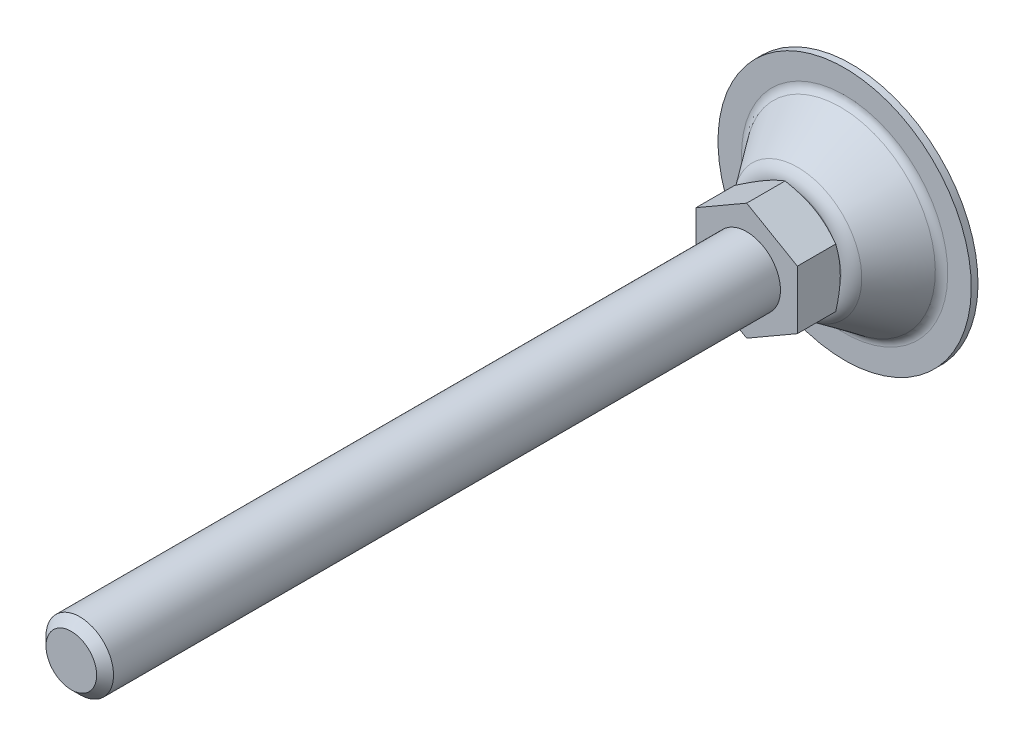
ISO-10303-21;
HEADER;
FILE_DESCRIPTION(('STEP AP214'),'2;1');
FILE_NAME('part.step','',(''),(''),'','','');
FILE_SCHEMA(('AUTOMOTIVE_DESIGN { 1 0 10303 214 1 1 1 1 }'));
ENDSEC;
DATA;
#1=APPLICATION_CONTEXT('core data for automotive mechanical design processes');
#2=APPLICATION_PROTOCOL_DEFINITION('international standard','automotive_design',2000,#1);
#3=PRODUCT_CONTEXT('',#1,'mechanical');
#4=PRODUCT('Part','Part','',(#3));
#5=PRODUCT_RELATED_PRODUCT_CATEGORY('part','',(#4));
#6=PRODUCT_DEFINITION_FORMATION('','',#4);
#7=PRODUCT_DEFINITION_CONTEXT('part definition',#1,'design');
#8=PRODUCT_DEFINITION('design','',#6,#7);
#9=PRODUCT_DEFINITION_SHAPE('','',#8);
#10=(LENGTH_UNIT() NAMED_UNIT(*) SI_UNIT(.MILLI.,.METRE.));
#11=(NAMED_UNIT(*) PLANE_ANGLE_UNIT() SI_UNIT($,.RADIAN.));
#12=(NAMED_UNIT(*) SI_UNIT($,.STERADIAN.) SOLID_ANGLE_UNIT());
#13=UNCERTAINTY_MEASURE_WITH_UNIT(LENGTH_MEASURE(1.E-05),#10,'distance_accuracy_value','');
#14=(GEOMETRIC_REPRESENTATION_CONTEXT(3) GLOBAL_UNCERTAINTY_ASSIGNED_CONTEXT((#13)) GLOBAL_UNIT_ASSIGNED_CONTEXT((#10,
#11,#12)) REPRESENTATION_CONTEXT('',''));
#15=CARTESIAN_POINT('',(0.,0.,0.));
#16=DIRECTION('',(0.,0.,1.));
#17=DIRECTION('',(1.,0.,0.));
#18=AXIS2_PLACEMENT_3D('',#15,#16,#17);
#19=CARTESIAN_POINT('',(0.,0.,31.));
#20=DIRECTION('',(0.,0.,1.));
#21=DIRECTION('',(0.5,-0.86602540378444,0.));
#22=AXIS2_PLACEMENT_3D('',#19,#20,#21);
#23=PLANE('',#22);
#24=DIRECTION('',(0.,1.,0.));
#25=VECTOR('',#24,1.);
#26=CARTESIAN_POINT('',(15.,-8.66025403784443,31.));
#27=LINE('',#26,#25);
#28=CARTESIAN_POINT('',(15.,-8.66025403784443,31.));
#29=VERTEX_POINT('',#28);
#30=CARTESIAN_POINT('',(15.,8.66025403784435,31.));
#31=VERTEX_POINT('',#30);
#32=EDGE_CURVE('E220',#29,#31,#27,.T.);
#33=ORIENTED_EDGE('',*,*,#32,.T.);
#34=DIRECTION('',(-0.866025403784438,0.5,0.));
#35=VECTOR('',#34,1.);
#36=CARTESIAN_POINT('',(15.,8.66025403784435,31.));
#37=LINE('',#36,#35);
#38=CARTESIAN_POINT('',(0.,17.3205080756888,31.));
#39=VERTEX_POINT('',#38);
#40=EDGE_CURVE('E266',#31,#39,#37,.T.);
#41=ORIENTED_EDGE('',*,*,#40,.T.);
#42=DIRECTION('',(-0.866025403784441,-0.5,0.));
#43=VECTOR('',#42,1.);
#44=CARTESIAN_POINT('',(0.,17.3205080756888,31.));
#45=LINE('',#44,#43);
#46=CARTESIAN_POINT('',(-15.,8.66025403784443,31.));
#47=VERTEX_POINT('',#46);
#48=EDGE_CURVE('E264',#39,#47,#45,.T.);
#49=ORIENTED_EDGE('',*,*,#48,.T.);
#50=DIRECTION('',(0.,-1.,0.));
#51=VECTOR('',#50,1.);
#52=CARTESIAN_POINT('',(-15.,8.66025403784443,31.));
#53=LINE('',#52,#51);
#54=CARTESIAN_POINT('',(-15.,-8.66025403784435,31.));
#55=VERTEX_POINT('',#54);
#56=EDGE_CURVE('E261',#47,#55,#53,.T.);
#57=ORIENTED_EDGE('',*,*,#56,.T.);
#58=DIRECTION('',(0.866025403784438,-0.5,0.));
#59=VECTOR('',#58,1.);
#60=CARTESIAN_POINT('',(-15.,-8.66025403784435,31.));
#61=LINE('',#60,#59);
#62=CARTESIAN_POINT('',(0.,-17.3205080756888,31.));
#63=VERTEX_POINT('',#62);
#64=EDGE_CURVE('E271',#55,#63,#61,.T.);
#65=ORIENTED_EDGE('',*,*,#64,.T.);
#66=DIRECTION('',(0.866025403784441,0.5,0.));
#67=VECTOR('',#66,1.);
#68=CARTESIAN_POINT('',(0.,-17.3205080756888,31.));
#69=LINE('',#68,#67);
#70=EDGE_CURVE('E37',#63,#29,#69,.T.);
#71=ORIENTED_EDGE('',*,*,#70,.T.);
#72=EDGE_LOOP('',(#33,#41,#49,#57,#65,#71));
#73=FACE_BOUND('',#72,.T.);
#74=CARTESIAN_POINT('',(0.,0.,31.));
#75=DIRECTION('',(0.,0.,1.));
#76=DIRECTION('',(0.5,-0.86602540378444,0.));
#77=AXIS2_PLACEMENT_3D('',#74,#75,#76);
#78=CIRCLE('',#77,10.);
#79=CARTESIAN_POINT('',(5.,-8.6602540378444,31.));
#80=VERTEX_POINT('',#79);
#81=EDGE_CURVE('E224',#80,#80,#78,.T.);
#82=ORIENTED_EDGE('',*,*,#81,.F.);
#83=EDGE_LOOP('',(#82));
#84=FACE_BOUND('',#83,.T.);
#85=ADVANCED_FACE('F14',(#73,#84),#23,.T.);
#86=CARTESIAN_POINT('',(-1.54390389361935E-13,2.67411998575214E-13,4.9999999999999));
#87=DIRECTION('',(0.,0.,1.));
#88=DIRECTION('',(0.5,-0.86602540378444,0.));
#89=AXIS2_PLACEMENT_3D('',#86,#87,#88);
#90=TOROIDAL_SURFACE('',#89,30.5382613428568,3.);
#91=CARTESIAN_POINT('',(-1.55741344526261E-13,2.69751921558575E-13,3.24909185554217));
#92=DIRECTION('',(0.,0.,1.));
#93=DIRECTION('',(0.5,-0.86602540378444,0.));
#94=AXIS2_PLACEMENT_3D('',#91,#92,#93);
#95=CIRCLE('',#94,28.1022152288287);
#96=CARTESIAN_POINT('',(14.0511076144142,-24.3372322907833,3.2490918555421));
#97=VERTEX_POINT('',#96);
#98=EDGE_CURVE('E73',#97,#97,#95,.T.);
#99=ORIENTED_EDGE('',*,*,#98,.F.);
#100=EDGE_LOOP('',(#99));
#101=FACE_BOUND('',#100,.T.);
#102=CARTESIAN_POINT('',(-1.57301461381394E-13,2.72454123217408E-13,1.99999999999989));
#103=DIRECTION('',(0.,0.,1.));
#104=DIRECTION('',(0.5,-0.86602540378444,0.));
#105=AXIS2_PLACEMENT_3D('',#102,#103,#104);
#106=CIRCLE('',#105,30.5382613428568);
#107=CARTESIAN_POINT('',(15.2691306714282,-26.446910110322,1.99999999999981));
#108=VERTEX_POINT('',#107);
#109=EDGE_CURVE('E102',#108,#108,#106,.T.);
#110=ORIENTED_EDGE('',*,*,#109,.T.);
#111=EDGE_LOOP('',(#110));
#112=FACE_BOUND('',#111,.T.);
#113=ADVANCED_FACE('F198',(#101,#112),#90,.F.);
#114=CARTESIAN_POINT('',(-1.55741344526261E-13,2.69751921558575E-13,3.24909185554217));
#115=DIRECTION('',(0.,0.,-1.));
#116=DIRECTION('',(-0.5,0.86602540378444,0.));
#117=AXIS2_PLACEMENT_3D('',#114,#115,#116);
#118=CONICAL_SURFACE('',#117,28.1022152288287,0.623199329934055);
#119=CARTESIAN_POINT('',(-1.39917641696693E-13,2.42344464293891E-13,15.9181802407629));
#120=DIRECTION('',(0.,0.,1.));
#121=DIRECTION('',(0.5,-0.86602540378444,0.));
#122=AXIS2_PLACEMENT_3D('',#119,#120,#121);
#123=CIRCLE('',#122,18.9963079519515);
#124=CARTESIAN_POINT('',(9.49815397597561,-16.4512852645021,15.9181802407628));
#125=VERTEX_POINT('',#124);
#126=EDGE_CURVE('E111',#125,#125,#123,.T.);
#127=ORIENTED_EDGE('',*,*,#126,.F.);
#128=EDGE_LOOP('',(#127));
#129=FACE_BOUND('',#128,.T.);
#130=ORIENTED_EDGE('',*,*,#98,.T.);
#131=EDGE_LOOP('',(#130));
#132=FACE_BOUND('',#131,.T.);
#133=ADVANCED_FACE('F195',(#129,#132),#118,.T.);
#134=CARTESIAN_POINT('',(-1.43982048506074E-13,2.49384223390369E-13,13.));
#135=DIRECTION('',(0.,0.,1.));
#136=DIRECTION('',(0.5,-0.86602540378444,0.));
#137=AXIS2_PLACEMENT_3D('',#134,#135,#136);
#138=TOROIDAL_SURFACE('',#137,14.9362310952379,5.);
#139=CARTESIAN_POINT('',(-1.43982048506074E-13,2.49384223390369E-13,18.));
#140=DIRECTION('',(0.,0.,1.));
#141=DIRECTION('',(0.5,-0.86602540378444,0.));
#142=AXIS2_PLACEMENT_3D('',#139,#140,#141);
#143=CIRCLE('',#142,14.9362310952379);
#144=CARTESIAN_POINT('',(7.46811554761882,-12.9351555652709,18.));
#145=VERTEX_POINT('',#144);
#146=EDGE_CURVE('E84',#145,#145,#143,.T.);
#147=ORIENTED_EDGE('',*,*,#146,.F.);
#148=EDGE_LOOP('',(#147));
#149=FACE_BOUND('',#148,.T.);
#150=ORIENTED_EDGE('',*,*,#126,.T.);
#151=EDGE_LOOP('',(#150));
#152=FACE_BOUND('',#151,.T.);
#153=ADVANCED_FACE('F191',(#149,#152),#138,.T.);
#154=CARTESIAN_POINT('',(-18.75,32.4759526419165,0.));
#155=DIRECTION('',(0.,0.,1.));
#156=DIRECTION('',(0.5,-0.86602540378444,0.));
#157=AXIS2_PLACEMENT_3D('',#154,#155,#156);
#158=PLANE('',#157);
#159=CARTESIAN_POINT('',(-1.59799463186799E-13,2.76780789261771E-13,-1.38777878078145E-13));
#160=DIRECTION('',(0.,0.,1.));
#161=DIRECTION('',(0.5,-0.86602540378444,0.));
#162=AXIS2_PLACEMENT_3D('',#159,#160,#161);
#163=CIRCLE('',#162,37.5);
#164=CARTESIAN_POINT('',(18.7499999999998,-32.4759526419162,-2.32452945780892E-13));
#165=VERTEX_POINT('',#164);
#166=EDGE_CURVE('E108',#165,#165,#163,.T.);
#167=ORIENTED_EDGE('',*,*,#166,.F.);
#168=EDGE_LOOP('',(#167));
#169=FACE_BOUND('',#168,.T.);
#170=ADVANCED_FACE('F187',(#169),#158,.F.);
#171=CARTESIAN_POINT('',(0.,0.,129.670029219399));
#172=DIRECTION('',(0.,0.,1.));
#173=DIRECTION('',(0.5,-0.86602540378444,0.));
#174=AXIS2_PLACEMENT_3D('',#171,#172,#173);
#175=CYLINDRICAL_SURFACE('',#174,37.5);
#176=CARTESIAN_POINT('',(-1.57301461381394E-13,2.72454123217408E-13,1.99999999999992));
#177=DIRECTION('',(0.,0.,1.));
#178=DIRECTION('',(0.5,-0.86602540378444,0.));
#179=AXIS2_PLACEMENT_3D('',#176,#177,#178);
#180=CIRCLE('',#179,37.5);
#181=CARTESIAN_POINT('',(18.7499999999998,-32.4759526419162,1.99999999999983));
#182=VERTEX_POINT('',#181);
#183=EDGE_CURVE('E105',#182,#182,#180,.T.);
#184=ORIENTED_EDGE('',*,*,#183,.F.);
#185=EDGE_LOOP('',(#184));
#186=FACE_BOUND('',#185,.T.);
#187=ORIENTED_EDGE('',*,*,#166,.T.);
#188=EDGE_LOOP('',(#187));
#189=FACE_BOUND('',#188,.T.);
#190=ADVANCED_FACE('F183',(#186,#189),#175,.T.);
#191=CARTESIAN_POINT('',(-18.75,32.4759526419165,2.));
#192=DIRECTION('',(0.,0.,-1.));
#193=DIRECTION('',(-0.5,0.86602540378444,0.));
#194=AXIS2_PLACEMENT_3D('',#191,#192,#193);
#195=PLANE('',#194);
#196=ORIENTED_EDGE('',*,*,#109,.F.);
#197=EDGE_LOOP('',(#196));
#198=FACE_BOUND('',#197,.T.);
#199=ORIENTED_EDGE('',*,*,#183,.T.);
#200=EDGE_LOOP('',(#199));
#201=FACE_BOUND('',#200,.T.);
#202=ADVANCED_FACE('F128',(#198,#201),#195,.F.);
#203=CARTESIAN_POINT('',(0.,0.,23.0943491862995));
#204=DIRECTION('',(0.,0.,1.));
#205=DIRECTION('',(0.5,-0.86602540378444,0.));
#206=AXIS2_PLACEMENT_3D('',#203,#204,#205);
#207=CONICAL_SURFACE('',#206,23.323671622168,1.0471975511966);
#208=CARTESIAN_POINT('',(0.,0.,18.));
#209=DIRECTION('',(0.,0.,-1.));
#210=DIRECTION('',(-0.5,0.86602540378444,0.));
#211=AXIS2_PLACEMENT_3D('',#208,#209,#210);
#212=CIRCLE('',#211,14.5);
#213=CARTESIAN_POINT('',(-7.25,12.5573683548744,18.));
#214=VERTEX_POINT('',#213);
#215=EDGE_CURVE('E226',#214,#214,#212,.T.);
#216=ORIENTED_EDGE('',*,*,#215,.F.);
#217=EDGE_LOOP('',(#216));
#218=FACE_BOUND('',#217,.T.);
#219=CARTESIAN_POINT('',(-12.7752963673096,-24.6963288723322,25.6816332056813));
#220=CARTESIAN_POINT('',(-12.4910694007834,-24.5322303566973,25.5220895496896));
#221=CARTESIAN_POINT('',(-12.206512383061,-24.3679412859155,25.3633302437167));
#222=CARTESIAN_POINT('',(-11.6366694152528,-24.0389422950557,25.0475576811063));
#223=CARTESIAN_POINT('',(-11.3513834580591,-23.8742323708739,24.8905444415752));
#224=CARTESIAN_POINT('',(-10.4942547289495,-23.3793688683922,24.4223494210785));
#225=CARTESIAN_POINT('',(-9.92122319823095,-23.0485289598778,24.1140585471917));
#226=CARTESIAN_POINT('',(-8.76831153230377,-22.3828950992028,23.5053939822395));
#227=CARTESIAN_POINT('',(-8.18841117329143,-22.0480894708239,23.2050712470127));
#228=CARTESIAN_POINT('',(-7.02404380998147,-21.3758416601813,22.6165131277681));
#229=CARTESIAN_POINT('',(-6.43957701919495,-21.0383996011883,22.3282771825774));
#230=CARTESIAN_POINT('',(-5.24579106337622,-20.3491669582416,21.7578369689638));
#231=CARTESIAN_POINT('',(-4.6362875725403,-19.9972699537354,21.4761443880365));
#232=CARTESIAN_POINT('',(-3.41019349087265,-19.2893842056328,20.9337181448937));
#233=CARTESIAN_POINT('',(-2.79360212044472,-18.9333950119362,20.6729868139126));
#234=CARTESIAN_POINT('',(-1.55348395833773,-18.2174124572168,20.1792225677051));
#235=CARTESIAN_POINT('',(-0.929973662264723,-17.8574286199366,19.9461348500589));
#236=CARTESIAN_POINT('',(0.326048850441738,-17.1322636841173,19.5150244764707));
#237=CARTESIAN_POINT('',(0.958558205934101,-16.7670842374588,19.3169909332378));
#238=CARTESIAN_POINT('',(1.91243675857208,-16.216362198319,19.0538662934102));
#239=CARTESIAN_POINT('',(2.2303543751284,-16.0328123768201,18.9719940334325));
#240=CARTESIAN_POINT('',(2.8683856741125,-15.6644448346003,18.8205188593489));
#241=CARTESIAN_POINT('',(3.18849931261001,-15.4796271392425,18.7509157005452));
#242=CARTESIAN_POINT('',(3.83071190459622,-15.1088455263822,18.6251978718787));
#243=CARTESIAN_POINT('',(4.15281082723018,-14.9228816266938,18.5690829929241));
#244=CARTESIAN_POINT('',(4.79866142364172,-14.5499996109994,18.4714557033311));
#245=CARTESIAN_POINT('',(5.12241302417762,-14.3630815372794,18.4299426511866));
#246=CARTESIAN_POINT('',(5.7668346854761,-13.9910245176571,18.3628722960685));
#247=CARTESIAN_POINT('',(6.08748870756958,-13.8058948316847,18.3371107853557));
#248=CARTESIAN_POINT('',(6.72945271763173,-13.4352567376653,18.3012764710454));
#249=CARTESIAN_POINT('',(7.05076269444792,-13.2497483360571,18.2912034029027));
#250=CARTESIAN_POINT('',(7.69346432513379,-12.878684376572,18.2869861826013));
#251=CARTESIAN_POINT('',(8.0148559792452,-12.6931288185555,18.2928420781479));
#252=CARTESIAN_POINT('',(8.65713622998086,-12.3223081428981,18.3203381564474));
#253=CARTESIAN_POINT('',(8.9780248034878,-12.1370430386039,18.3419790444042));
#254=CARTESIAN_POINT('',(9.74531187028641,-11.694049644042,18.4121345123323));
#255=CARTESIAN_POINT('',(10.1912229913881,-11.4366027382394,18.4678874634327));
#256=CARTESIAN_POINT('',(11.0798234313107,-10.9235690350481,18.6068735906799));
#257=CARTESIAN_POINT('',(11.5225123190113,-10.6679824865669,18.6901103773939));
#258=CARTESIAN_POINT('',(12.4042155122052,-10.158930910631,18.881103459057));
#259=CARTESIAN_POINT('',(12.84322676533,-9.90546764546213,18.988878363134));
#260=CARTESIAN_POINT('',(13.7168888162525,-9.40105862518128,19.2256508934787));
#261=CARTESIAN_POINT('',(14.151539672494,-9.15011283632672,19.3546482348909));
#262=CARTESIAN_POINT('',(15.0261682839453,-8.64514577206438,19.6338079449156));
#263=CARTESIAN_POINT('',(15.466047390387,-8.39118145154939,19.7843795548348));
#264=CARTESIAN_POINT('',(16.3414739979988,-7.8857536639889,20.1013827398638));
#265=CARTESIAN_POINT('',(16.7770214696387,-7.63429021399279,20.267814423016));
#266=CARTESIAN_POINT('',(17.6439961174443,-7.13374216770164,20.6138686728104));
#267=CARTESIAN_POINT('',(18.0754245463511,-6.88465684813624,20.7934870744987));
#268=CARTESIAN_POINT('',(18.9346884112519,-6.38856062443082,21.1637718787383));
#269=CARTESIAN_POINT('',(19.3625238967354,-6.14154969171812,21.3544381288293));
#270=CARTESIAN_POINT('',(20.4004383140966,-5.54230952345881,21.829942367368));
#271=CARTESIAN_POINT('',(21.0088362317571,-5.19105082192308,22.1196663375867));
#272=CARTESIAN_POINT('',(22.2202116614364,-4.49166289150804,22.7138939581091));
#273=CARTESIAN_POINT('',(22.8231887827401,-4.14353388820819,23.0183986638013));
#274=CARTESIAN_POINT('',(24.0247789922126,-3.44979545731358,23.6391170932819));
#275=CARTESIAN_POINT('',(24.6233909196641,-3.10418669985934,23.9553338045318));
#276=CARTESIAN_POINT('',(25.8168545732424,-2.41514013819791,24.5970218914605));
#277=CARTESIAN_POINT('',(26.4117063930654,-2.07170227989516,24.9224930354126));
#278=CARTESIAN_POINT('',(27.5990157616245,-1.38620889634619,25.5812970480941));
#279=CARTESIAN_POINT('',(28.1914695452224,-1.04415554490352,25.9146389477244));
#280=CARTESIAN_POINT('',(29.3737746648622,-0.36155136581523,26.5874202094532));
#281=CARTESIAN_POINT('',(29.9636259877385,-0.0210005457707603,26.9268596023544));
#282=CARTESIAN_POINT('',(31.1410545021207,0.658788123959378,27.6107079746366));
#283=CARTESIAN_POINT('',(31.728632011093,0.998026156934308,27.9551162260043));
#284=CARTESIAN_POINT('',(32.9019328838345,1.67543173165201,28.6481104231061));
#285=CARTESIAN_POINT('',(33.4876562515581,2.01359927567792,28.9966963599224));
#286=CARTESIAN_POINT('',(35.1389838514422,2.96699370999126,29.9857106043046));
#287=CARTESIAN_POINT('',(36.2027654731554,3.5811683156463,30.6301961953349));
#288=CARTESIAN_POINT('',(38.3264251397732,4.80726379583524,31.9277855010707));
#289=CARTESIAN_POINT('',(39.3863030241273,5.4191845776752,32.5808895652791));
#290=CARTESIAN_POINT('',(41.5001458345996,6.63961229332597,33.8918828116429));
#291=CARTESIAN_POINT('',(42.5541189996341,7.24812398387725,34.5497542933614));
#292=CARTESIAN_POINT('',(44.1332517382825,8.15983669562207,35.5403535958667));
#293=CARTESIAN_POINT('',(44.6593093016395,8.46355617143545,35.8711755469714));
#294=CARTESIAN_POINT('',(45.7108863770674,9.07068447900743,36.5339556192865));
#295=CARTESIAN_POINT('',(46.2364058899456,9.37409331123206,36.865913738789));
#296=CARTESIAN_POINT('',(46.7616874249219,9.67736474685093,37.1983733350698));
#297=B_SPLINE_CURVE_WITH_KNOTS('',3,(#219,#220,#221,#222,#223,#224,#225,#226,#227,#228,#229,
#230,#231,#232,#233,#234,#235,#236,#237,#238,#239,#240,#241,#242,#243,#244,#245,#246,#247,#248,
#249,#250,#251,#252,#253,#254,#255,#256,#257,#258,#259,#260,#261,#262,#263,#264,#265,#266,#267,
#268,#269,#270,#271,#272,#273,#274,#275,#276,#277,#278,#279,#280,#281,#282,#283,#284,#285,#286,
#287,#288,#289,#290,#291,#292,#293,#294,#295,#296),.UNSPECIFIED.,.F.,.F.,(4,2,2,2,2,2,2,2,2,2,2,
2,2,2,2,2,2,2,2,2,2,2,2,2,2,2,2,2,2,2,2,2,2,2,2,2,2,2,4),(0.,1.09476161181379,2.18953393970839,
4.37939496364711,6.58092776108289,8.7823582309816,11.0563262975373,13.3305469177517,
15.6001808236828,17.869108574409,18.9972925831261,20.1254540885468,21.2535981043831,
22.3816925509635,23.4948335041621,24.6079556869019,25.7210812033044,26.8342564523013,
28.3871111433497,29.9401699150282,31.4944104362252,33.0486300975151,34.6376511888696,
36.2266831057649,37.815215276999,39.4037255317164,41.6832356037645,43.9629086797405,
46.2431673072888,48.5233688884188,50.8063278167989,53.0892982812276,55.3719375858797,
57.6545720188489,61.8159896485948,65.9775765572,70.1279174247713,72.2029652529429,
74.2780099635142),.UNSPECIFIED.);
#298=CARTESIAN_POINT('',(0.,-17.3205080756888,19.6284210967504));
#299=VERTEX_POINT('',#298);
#300=CARTESIAN_POINT('',(15.,-8.66025403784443,19.6284210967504));
#301=VERTEX_POINT('',#300);
#302=EDGE_CURVE('E65',#299,#301,#297,.T.);
#303=ORIENTED_EDGE('',*,*,#302,.F.);
#304=CARTESIAN_POINT('',(-15.0002,-8.66013856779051,19.6284877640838));
#305=CARTESIAN_POINT('',(-14.6705058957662,-8.85048754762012,19.5185969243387));
#306=CARTESIAN_POINT('',(-14.3395258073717,-9.04157899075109,19.4136927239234));
#307=CARTESIAN_POINT('',(-13.674911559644,-9.42529420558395,19.2152437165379));
#308=CARTESIAN_POINT('',(-13.3412765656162,-9.61791845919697,19.1217026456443));
#309=CARTESIAN_POINT('',(-12.6707077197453,-10.0050715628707,18.9472372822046));
#310=CARTESIAN_POINT('',(-12.333767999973,-10.1996038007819,18.866342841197));
#311=CARTESIAN_POINT('',(-11.6575472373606,-10.5900200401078,18.7189077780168));
#312=CARTESIAN_POINT('',(-11.3182663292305,-10.7859039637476,18.6523663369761));
#313=CARTESIAN_POINT('',(-10.6460568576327,-11.1740042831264,18.5364675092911));
#314=CARTESIAN_POINT('',(-10.3131781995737,-11.3661918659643,18.4867265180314));
#315=CARTESIAN_POINT('',(-9.64589556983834,-11.7514476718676,18.4033218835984));
#316=CARTESIAN_POINT('',(-9.31149156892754,-11.9445159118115,18.3696585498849));
#317=CARTESIAN_POINT('',(-8.64212181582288,-12.3309767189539,18.3192592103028));
#318=CARTESIAN_POINT('',(-8.30715720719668,-12.5243686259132,18.3025030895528));
#319=CARTESIAN_POINT('',(-7.63691878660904,-12.9113309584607,18.2862785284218));
#320=CARTESIAN_POINT('',(-7.3016449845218,-13.104901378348,18.2868095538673));
#321=CARTESIAN_POINT('',(-6.67485311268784,-13.4667798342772,18.303951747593));
#322=CARTESIAN_POINT('',(-6.38329037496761,-13.6351136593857,18.3184719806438));
#323=CARTESIAN_POINT('',(-5.80083556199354,-13.971394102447,18.3603122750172));
#324=CARTESIAN_POINT('',(-5.50994353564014,-14.1393406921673,18.3876332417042));
#325=CARTESIAN_POINT('',(-4.9289881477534,-14.4747554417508,18.4545986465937));
#326=CARTESIAN_POINT('',(-4.63892567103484,-14.6422230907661,18.4942532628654));
#327=CARTESIAN_POINT('',(-4.06016058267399,-14.9763732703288,18.5851902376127));
#328=CARTESIAN_POINT('',(-3.77145806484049,-15.1430557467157,18.636473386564));
#329=CARTESIAN_POINT('',(-2.89508556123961,-15.6490296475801,18.8090619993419));
#330=CARTESIAN_POINT('',(-2.30995340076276,-15.9868558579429,18.9475763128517));
#331=CARTESIAN_POINT('',(-1.14841408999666,-16.657470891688,19.26194710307));
#332=CARTESIAN_POINT('',(-0.571992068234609,-16.9902683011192,19.4377297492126));
#333=CARTESIAN_POINT('',(0.000199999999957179,-17.3206235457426,19.6284877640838));
#334=B_SPLINE_CURVE_WITH_KNOTS('',3,(#304,#305,#306,#307,#308,#309,#310,#311,#312,#313,#314,
#315,#316,#317,#318,#319,#320,#321,#322,#323,#324,#325,#326,#327,#328,#329,#330,#331,#332,#333),
.UNSPECIFIED.,.F.,.F.,(4,2,2,2,2,2,2,2,2,2,2,2,2,2,4),(0.,1.18875411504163,2.37789802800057,
3.56980778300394,4.76164951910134,5.92407379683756,7.08652044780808,8.24758247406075,
9.40860862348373,10.4193068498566,11.4300765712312,12.4416826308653,13.4533574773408,
15.5211962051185,17.5849760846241),.UNSPECIFIED.);
#335=CARTESIAN_POINT('',(-15.,-8.66025403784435,19.6284210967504));
#336=VERTEX_POINT('',#335);
#337=EDGE_CURVE('E68',#336,#299,#334,.T.);
#338=ORIENTED_EDGE('',*,*,#337,.F.);
#339=CARTESIAN_POINT('',(-15.,8.66048497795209,19.6284877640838));
#340=CARTESIAN_POINT('',(-15.,8.27978701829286,19.5185969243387));
#341=CARTESIAN_POINT('',(-15.,7.89760413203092,19.4136927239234));
#342=CARTESIAN_POINT('',(-15.,7.1301737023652,19.2152437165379));
#343=CARTESIAN_POINT('',(-15.,6.74492519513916,19.1217026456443));
#344=CARTESIAN_POINT('',(-15.,5.97061898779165,18.9472372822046));
#345=CARTESIAN_POINT('',(-15.,5.58155451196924,18.866342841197));
#346=CARTESIAN_POINT('',(-15.,4.80072203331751,18.7189077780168));
#347=CARTESIAN_POINT('',(-15.,4.40895418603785,18.6523663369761));
#348=CARTESIAN_POINT('',(-15.,3.63275354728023,18.5364675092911));
#349=CARTESIAN_POINT('',(-15.,3.24837838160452,18.4867265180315));
#350=CARTESIAN_POINT('',(-15.,2.47786676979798,18.4033218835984));
#351=CARTESIAN_POINT('',(-15.,2.09173028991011,18.3696585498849));
#352=CARTESIAN_POINT('',(-15.,1.31880867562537,18.3192592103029));
#353=CARTESIAN_POINT('',(-15.,0.932024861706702,18.3025030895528));
#354=CARTESIAN_POINT('',(-15.,0.158100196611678,18.2862785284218));
#355=CARTESIAN_POINT('',(-15.,-0.229040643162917,18.2868095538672));
#356=CARTESIAN_POINT('',(-15.,-0.95279755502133,18.303951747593));
#357=CARTESIAN_POINT('',(-15.,-1.2894652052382,18.3184719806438));
#358=CARTESIAN_POINT('',(-15.,-1.96202609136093,18.3603122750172));
#359=CARTESIAN_POINT('',(-15.,-2.29791927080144,18.3876332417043));
#360=CARTESIAN_POINT('',(-15.,-2.96874876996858,18.4545986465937));
#361=CARTESIAN_POINT('',(-15.,-3.30368406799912,18.4942532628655));
#362=CARTESIAN_POINT('',(-15.,-3.97198442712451,18.5851902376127));
#363=CARTESIAN_POINT('',(-15.,-4.30534937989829,18.636473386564));
#364=CARTESIAN_POINT('',(-15.,-5.317297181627,18.8090619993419));
#365=CARTESIAN_POINT('',(-15.,-5.99294960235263,18.9475763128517));
#366=CARTESIAN_POINT('',(-15.,-7.33417966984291,19.26194710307));
#367=CARTESIAN_POINT('',(-15.,-7.99977448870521,19.4377297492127));
#368=CARTESIAN_POINT('',(-15.,-8.66048497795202,19.6284877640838));
#369=B_SPLINE_CURVE_WITH_KNOTS('',3,(#339,#340,#341,#342,#343,#344,#345,#346,#347,#348,#349,
#350,#351,#352,#353,#354,#355,#356,#357,#358,#359,#360,#361,#362,#363,#364,#365,#366,#367,#368),
.UNSPECIFIED.,.F.,.F.,(4,2,2,2,2,2,2,2,2,2,2,2,2,2,4),(0.,1.18875411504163,2.37789802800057,
3.56980778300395,4.76164951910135,5.92407379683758,7.08652044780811,8.24758247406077,
9.40860862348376,10.4193068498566,11.4300765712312,12.4416826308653,13.4533574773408,
15.5211962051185,17.5849760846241),.UNSPECIFIED.);
#370=CARTESIAN_POINT('',(-15.,8.66025403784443,19.6284210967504));
#371=VERTEX_POINT('',#370);
#372=EDGE_CURVE('E83',#371,#336,#369,.T.);
#373=ORIENTED_EDGE('',*,*,#372,.F.);
#374=CARTESIAN_POINT('',(-27.7752963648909,1.28443324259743,25.6816332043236));
#375=CARTESIAN_POINT('',(-27.4910693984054,1.44853175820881,25.5220895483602));
#376=CARTESIAN_POINT('',(-27.2065123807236,1.61282082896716,25.3633302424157));
#377=CARTESIAN_POINT('',(-26.6366694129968,1.94181981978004,25.0475576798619));
#378=CARTESIAN_POINT('',(-26.3513834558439,2.10652974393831,24.8905444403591));
#379=CARTESIAN_POINT('',(-25.4942547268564,2.60139324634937,24.4223494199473));
#380=CARTESIAN_POINT('',(-24.9212231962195,2.93223315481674,24.1140585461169));
#381=CARTESIAN_POINT('',(-23.7683115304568,3.59786701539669,23.5053939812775));
#382=CARTESIAN_POINT('',(-23.1884111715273,3.93267264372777,23.2050712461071));
#383=CARTESIAN_POINT('',(-22.0240438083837,4.60492045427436,22.6165131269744));
#384=CARTESIAN_POINT('',(-21.4395770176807,4.94236251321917,22.3282771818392));
#385=CARTESIAN_POINT('',(-20.2457910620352,5.63159515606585,21.7578369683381));
#386=CARTESIAN_POINT('',(-19.6362875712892,5.98349216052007,21.4761443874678));
#387=CARTESIAN_POINT('',(-18.4101934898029,6.69137790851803,20.9337181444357));
#388=CARTESIAN_POINT('',(-17.7936021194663,7.04736710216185,20.6729868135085));
#389=CARTESIAN_POINT('',(-16.5534839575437,7.76334965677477,20.1792225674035));
#390=CARTESIAN_POINT('',(-15.9299736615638,8.1233334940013,19.946134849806));
#391=CARTESIAN_POINT('',(-14.673951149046,8.84849842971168,19.5150244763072));
#392=CARTESIAN_POINT('',(-14.0414417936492,9.21367787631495,19.316990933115));
#393=CARTESIAN_POINT('',(-13.0875632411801,9.76439991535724,19.0538662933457));
#394=CARTESIAN_POINT('',(-12.769645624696,9.94794973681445,18.9719940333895));
#395=CARTESIAN_POINT('',(-12.1316143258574,10.3163172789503,18.8205188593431));
#396=CARTESIAN_POINT('',(-11.8115006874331,10.5011349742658,18.7509157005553));
#397=CARTESIAN_POINT('',(-11.1692880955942,10.871916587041,18.6251978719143));
#398=CARTESIAN_POINT('',(-10.8471891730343,11.0578804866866,18.5690829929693));
#399=CARTESIAN_POINT('',(-10.2013385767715,11.4307625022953,18.4714557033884));
#400=CARTESIAN_POINT('',(-9.87758697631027,11.6176805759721,18.4299426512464));
#401=CARTESIAN_POINT('',(-9.23316531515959,11.9897375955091,18.3628722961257));
#402=CARTESIAN_POINT('',(-8.91251129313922,12.1748672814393,18.337110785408));
#403=CARTESIAN_POINT('',(-8.27054728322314,12.5455053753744,18.3012764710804));
#404=CARTESIAN_POINT('',(-7.9492373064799,12.7310137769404,18.2912034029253));
#405=CARTESIAN_POINT('',(-7.3065356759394,13.1020777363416,18.2869861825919));
#406=CARTESIAN_POINT('',(-6.98514402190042,13.2876332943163,18.2928420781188));
#407=CARTESIAN_POINT('',(-6.34286377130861,13.6584539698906,18.3203381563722));
#408=CARTESIAN_POINT('',(-6.02197519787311,13.8437190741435,18.3419790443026));
#409=CARTESIAN_POINT('',(-5.25468813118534,14.2867124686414,18.4121345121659));
#410=CARTESIAN_POINT('',(-4.80877701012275,14.5441593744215,18.4678874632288));
#411=CARTESIAN_POINT('',(-3.92017657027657,15.0571930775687,18.6068735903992));
#412=CARTESIAN_POINT('',(-3.47748768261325,15.3127796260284,18.6901103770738));
#413=CARTESIAN_POINT('',(-2.59578448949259,15.821831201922,18.8811034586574));
#414=CARTESIAN_POINT('',(-2.15677323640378,16.0752944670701,18.9888783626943));
#415=CARTESIAN_POINT('',(-1.28311118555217,16.57970348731,19.2256508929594));
#416=CARTESIAN_POINT('',(-0.84846032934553,16.8306492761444,19.3546482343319));
#417=CARTESIAN_POINT('',(0.0261682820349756,17.3356163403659,19.6338079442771));
#418=CARTESIAN_POINT('',(0.466047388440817,17.5895806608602,19.7843795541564));
#419=CARTESIAN_POINT('',(1.34147399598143,18.0950084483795,20.1013827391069));
#420=CARTESIAN_POINT('',(1.7770214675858,18.3464718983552,20.2678144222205));
#421=CARTESIAN_POINT('',(2.64399611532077,18.8470199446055,20.6138686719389));
#422=CARTESIAN_POINT('',(3.07542454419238,19.0961052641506,20.7934870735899));
#423=CARTESIAN_POINT('',(3.93468840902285,19.5922014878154,21.1637718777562));
#424=CARTESIAN_POINT('',(4.36252389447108,19.8392124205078,21.3544381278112));
#425=CARTESIAN_POINT('',(5.40043831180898,20.4384525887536,21.8299423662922));
#426=CARTESIAN_POINT('',(6.0088362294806,20.7897112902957,22.1196663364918));
#427=CARTESIAN_POINT('',(7.22021165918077,21.4890992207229,22.7138939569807));
#428=CARTESIAN_POINT('',(7.82318878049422,21.8372282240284,23.0183986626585));
#429=CARTESIAN_POINT('',(9.0247789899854,22.5309666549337,23.639117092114));
#430=CARTESIAN_POINT('',(9.62339091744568,22.876575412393,23.955333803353));
#431=CARTESIAN_POINT('',(10.8168545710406,23.5656219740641,24.5970218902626));
#432=CARTESIAN_POINT('',(11.4117063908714,23.9090598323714,24.9224930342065));
#433=CARTESIAN_POINT('',(12.5990157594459,24.5945532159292,25.5812970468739));
#434=CARTESIAN_POINT('',(13.1914695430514,24.9366065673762,25.9146389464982));
#435=CARTESIAN_POINT('',(14.3737746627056,25.6192107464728,26.5874202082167));
#436=CARTESIAN_POINT('',(14.9636259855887,25.9597615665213,26.9268596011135));
#437=CARTESIAN_POINT('',(16.1410544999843,26.6395502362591,27.6107079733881));
#438=CARTESIAN_POINT('',(16.728632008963,26.9787882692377,27.9551162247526));
#439=CARTESIAN_POINT('',(17.9019328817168,27.6561938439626,28.6481104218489));
#440=CARTESIAN_POINT('',(18.4876562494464,27.9943613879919,28.996696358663));
#441=CARTESIAN_POINT('',(20.1389838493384,28.9477558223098,29.9857106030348));
#442=CARTESIAN_POINT('',(21.202765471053,29.5619304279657,30.6301961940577));
#443=CARTESIAN_POINT('',(23.3264251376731,30.788025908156,31.9277854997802));
#444=CARTESIAN_POINT('',(24.386303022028,31.3999466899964,32.5808895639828));
#445=CARTESIAN_POINT('',(26.5001458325,32.620374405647,33.8918828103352));
#446=CARTESIAN_POINT('',(27.5541189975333,33.2288860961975,34.549754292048));
#447=CARTESIAN_POINT('',(29.1332517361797,34.1405988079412,35.5403535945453));
#448=CARTESIAN_POINT('',(29.6593092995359,34.4443182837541,35.8711755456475));
#449=CARTESIAN_POINT('',(30.7108863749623,35.0514465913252,36.5339556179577));
#450=CARTESIAN_POINT('',(31.2364058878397,35.3548554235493,36.8659137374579));
#451=CARTESIAN_POINT('',(31.7616874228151,35.6581268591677,37.1983733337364));
#452=B_SPLINE_CURVE_WITH_KNOTS('',3,(#374,#375,#376,#377,#378,#379,#380,#381,#382,#383,#384,
#385,#386,#387,#388,#389,#390,#391,#392,#393,#394,#395,#396,#397,#398,#399,#400,#401,#402,#403,
#404,#405,#406,#407,#408,#409,#410,#411,#412,#413,#414,#415,#416,#417,#418,#419,#420,#421,#422,
#423,#424,#425,#426,#427,#428,#429,#430,#431,#432,#433,#434,#435,#436,#437,#438,#439,#440,#441,
#442,#443,#444,#445,#446,#447,#448,#449,#450,#451),.UNSPECIFIED.,.F.,.F.,(4,2,2,2,2,2,2,2,2,2,2,
2,2,2,2,2,2,2,2,2,2,2,2,2,2,2,2,2,2,2,2,2,2,2,2,2,2,2,4),(0.,1.09476161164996,2.18953393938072,
4.37939496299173,6.58092776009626,8.78235822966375,11.0563262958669,13.3305469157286,
15.6001808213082,17.8691085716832,18.9972925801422,20.1254540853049,21.2535981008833,
22.3816925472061,23.4948335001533,24.6079556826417,25.7210811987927,26.834256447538,
28.3871111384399,29.9401699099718,31.494410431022,33.0486300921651,34.6376511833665,
36.2266831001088,37.8152152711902,39.403725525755,41.6832355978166,43.9629086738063,
46.2431673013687,48.5233688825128,50.8063278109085,53.0892982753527,55.3719375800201,
57.6545720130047,61.8159896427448,65.9775765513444,70.1279174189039,72.2029652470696,
74.278009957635),.UNSPECIFIED.);
#453=CARTESIAN_POINT('',(0.,17.3205080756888,19.6284210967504));
#454=VERTEX_POINT('',#453);
#455=EDGE_CURVE('E149',#454,#371,#452,.F.);
#456=ORIENTED_EDGE('',*,*,#455,.F.);
#457=CARTESIAN_POINT('',(15.0002,8.66013856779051,19.6284877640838));
#458=CARTESIAN_POINT('',(14.6705058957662,8.85048754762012,19.5185969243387));
#459=CARTESIAN_POINT('',(14.3395258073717,9.04157899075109,19.4136927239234));
#460=CARTESIAN_POINT('',(13.674911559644,9.42529420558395,19.2152437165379));
#461=CARTESIAN_POINT('',(13.3412765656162,9.61791845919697,19.1217026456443));
#462=CARTESIAN_POINT('',(12.6707077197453,10.0050715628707,18.9472372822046));
#463=CARTESIAN_POINT('',(12.333767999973,10.1996038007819,18.866342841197));
#464=CARTESIAN_POINT('',(11.6575472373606,10.5900200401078,18.7189077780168));
#465=CARTESIAN_POINT('',(11.3182663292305,10.7859039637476,18.6523663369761));
#466=CARTESIAN_POINT('',(10.6460568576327,11.1740042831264,18.5364675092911));
#467=CARTESIAN_POINT('',(10.3131781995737,11.3661918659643,18.4867265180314));
#468=CARTESIAN_POINT('',(9.64589556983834,11.7514476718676,18.4033218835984));
#469=CARTESIAN_POINT('',(9.31149156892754,11.9445159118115,18.3696585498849));
#470=CARTESIAN_POINT('',(8.64212181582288,12.3309767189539,18.3192592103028));
#471=CARTESIAN_POINT('',(8.30715720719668,12.5243686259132,18.3025030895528));
#472=CARTESIAN_POINT('',(7.63691878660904,12.9113309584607,18.2862785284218));
#473=CARTESIAN_POINT('',(7.3016449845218,13.104901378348,18.2868095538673));
#474=CARTESIAN_POINT('',(6.67485311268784,13.4667798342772,18.303951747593));
#475=CARTESIAN_POINT('',(6.38329037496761,13.6351136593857,18.3184719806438));
#476=CARTESIAN_POINT('',(5.80083556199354,13.971394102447,18.3603122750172));
#477=CARTESIAN_POINT('',(5.50994353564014,14.1393406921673,18.3876332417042));
#478=CARTESIAN_POINT('',(4.9289881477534,14.4747554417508,18.4545986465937));
#479=CARTESIAN_POINT('',(4.63892567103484,14.6422230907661,18.4942532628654));
#480=CARTESIAN_POINT('',(4.06016058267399,14.9763732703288,18.5851902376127));
#481=CARTESIAN_POINT('',(3.77145806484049,15.1430557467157,18.636473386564));
#482=CARTESIAN_POINT('',(2.89508556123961,15.6490296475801,18.8090619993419));
#483=CARTESIAN_POINT('',(2.30995340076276,15.9868558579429,18.9475763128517));
#484=CARTESIAN_POINT('',(1.14841408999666,16.657470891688,19.26194710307));
#485=CARTESIAN_POINT('',(0.571992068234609,16.9902683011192,19.4377297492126));
#486=CARTESIAN_POINT('',(-0.000199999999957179,17.3206235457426,19.6284877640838));
#487=B_SPLINE_CURVE_WITH_KNOTS('',3,(#457,#458,#459,#460,#461,#462,#463,#464,#465,#466,#467,
#468,#469,#470,#471,#472,#473,#474,#475,#476,#477,#478,#479,#480,#481,#482,#483,#484,#485,#486),
.UNSPECIFIED.,.F.,.F.,(4,2,2,2,2,2,2,2,2,2,2,2,2,2,4),(0.,1.18875411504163,2.37789802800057,
3.56980778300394,4.76164951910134,5.92407379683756,7.08652044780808,8.24758247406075,
9.40860862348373,10.4193068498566,11.4300765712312,12.4416826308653,13.4533574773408,
15.5211962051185,17.5849760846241),.UNSPECIFIED.);
#488=CARTESIAN_POINT('',(15.,8.66025403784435,19.6284210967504));
#489=VERTEX_POINT('',#488);
#490=EDGE_CURVE('E156',#489,#454,#487,.T.);
#491=ORIENTED_EDGE('',*,*,#490,.F.);
#492=CARTESIAN_POINT('',(15.,-8.66048497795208,19.6284877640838));
#493=CARTESIAN_POINT('',(15.,-8.27978701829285,19.5185969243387));
#494=CARTESIAN_POINT('',(15.,-7.89760413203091,19.4136927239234));
#495=CARTESIAN_POINT('',(15.,-7.13017370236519,19.2152437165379));
#496=CARTESIAN_POINT('',(15.,-6.74492519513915,19.1217026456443));
#497=CARTESIAN_POINT('',(15.,-5.97061898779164,18.9472372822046));
#498=CARTESIAN_POINT('',(15.,-5.58155451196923,18.866342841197));
#499=CARTESIAN_POINT('',(15.,-4.8007220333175,18.7189077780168));
#500=CARTESIAN_POINT('',(15.,-4.40895418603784,18.6523663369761));
#501=CARTESIAN_POINT('',(15.,-3.63275354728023,18.5364675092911));
#502=CARTESIAN_POINT('',(15.,-3.24837838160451,18.4867265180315));
#503=CARTESIAN_POINT('',(15.,-2.47786676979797,18.4033218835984));
#504=CARTESIAN_POINT('',(15.,-2.0917302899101,18.3696585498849));
#505=CARTESIAN_POINT('',(15.,-1.31880867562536,18.3192592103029));
#506=CARTESIAN_POINT('',(15.,-0.932024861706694,18.3025030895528));
#507=CARTESIAN_POINT('',(15.,-0.158100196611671,18.2862785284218));
#508=CARTESIAN_POINT('',(15.,0.229040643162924,18.2868095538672));
#509=CARTESIAN_POINT('',(15.,0.952797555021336,18.303951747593));
#510=CARTESIAN_POINT('',(15.,1.28946520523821,18.3184719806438));
#511=CARTESIAN_POINT('',(15.,1.96202609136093,18.3603122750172));
#512=CARTESIAN_POINT('',(15.,2.29791927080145,18.3876332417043));
#513=CARTESIAN_POINT('',(15.,2.96874876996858,18.4545986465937));
#514=CARTESIAN_POINT('',(15.,3.30368406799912,18.4942532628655));
#515=CARTESIAN_POINT('',(15.,3.97198442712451,18.5851902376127));
#516=CARTESIAN_POINT('',(15.,4.30534937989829,18.636473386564));
#517=CARTESIAN_POINT('',(15.,5.317297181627,18.8090619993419));
#518=CARTESIAN_POINT('',(15.,5.99294960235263,18.9475763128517));
#519=CARTESIAN_POINT('',(15.,7.33417966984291,19.26194710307));
#520=CARTESIAN_POINT('',(15.,7.99977448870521,19.4377297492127));
#521=CARTESIAN_POINT('',(15.,8.66048497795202,19.6284877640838));
#522=B_SPLINE_CURVE_WITH_KNOTS('',3,(#492,#493,#494,#495,#496,#497,#498,#499,#500,#501,#502,
#503,#504,#505,#506,#507,#508,#509,#510,#511,#512,#513,#514,#515,#516,#517,#518,#519,#520,#521),
.UNSPECIFIED.,.F.,.F.,(4,2,2,2,2,2,2,2,2,2,2,2,2,2,4),(0.,1.18875411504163,2.37789802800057,
3.56980778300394,4.76164951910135,5.92407379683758,7.08652044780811,8.24758247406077,
9.40860862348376,10.4193068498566,11.4300765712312,12.4416826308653,13.4533574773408,
15.5211962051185,17.584976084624),.UNSPECIFIED.);
#523=EDGE_CURVE('E29',#301,#489,#522,.T.);
#524=ORIENTED_EDGE('',*,*,#523,.F.);
#525=EDGE_LOOP('',(#303,#338,#373,#456,#491,#524));
#526=FACE_BOUND('',#525,.T.);
#527=ADVANCED_FACE('F67',(#218,#526),#207,.T.);
#528=CARTESIAN_POINT('',(12.5573683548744,7.25,18.));
#529=DIRECTION('',(0.,0.,-1.));
#530=DIRECTION('',(-0.5,0.86602540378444,0.));
#531=AXIS2_PLACEMENT_3D('',#528,#529,#530);
#532=PLANE('',#531);
#533=ORIENTED_EDGE('',*,*,#146,.T.);
#534=EDGE_LOOP('',(#533));
#535=FACE_BOUND('',#534,.T.);
#536=ORIENTED_EDGE('',*,*,#215,.T.);
#537=EDGE_LOOP('',(#536));
#538=FACE_BOUND('',#537,.T.);
#539=ADVANCED_FACE('F127',(#535,#538),#532,.F.);
#540=CARTESIAN_POINT('',(0.,-17.3205080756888,31.));
#541=DIRECTION('',(-0.5,0.866025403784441,0.));
#542=DIRECTION('',(-0.866025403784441,-0.5,0.));
#543=AXIS2_PLACEMENT_3D('',#540,#541,#542);
#544=PLANE('',#543);
#545=DIRECTION('',(0.,0.,-1.));
#546=VECTOR('',#545,1.);
#547=CARTESIAN_POINT('',(0.,-17.3205080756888,31.));
#548=LINE('',#547,#546);
#549=EDGE_CURVE('E80',#63,#299,#548,.T.);
#550=ORIENTED_EDGE('',*,*,#549,.T.);
#551=ORIENTED_EDGE('',*,*,#302,.T.);
#552=DIRECTION('',(0.,0.,-1.));
#553=VECTOR('',#552,1.);
#554=CARTESIAN_POINT('',(15.,-8.66025403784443,31.));
#555=LINE('',#554,#553);
#556=EDGE_CURVE('E87',#29,#301,#555,.T.);
#557=ORIENTED_EDGE('',*,*,#556,.F.);
#558=ORIENTED_EDGE('',*,*,#70,.F.);
#559=EDGE_LOOP('',(#550,#551,#557,#558));
#560=FACE_BOUND('',#559,.T.);
#561=ADVANCED_FACE('F86',(#560),#544,.F.);
#562=CARTESIAN_POINT('',(-15.,-8.66025403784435,31.));
#563=DIRECTION('',(0.5,0.866025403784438,0.));
#564=DIRECTION('',(-0.866025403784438,0.5,0.));
#565=AXIS2_PLACEMENT_3D('',#562,#563,#564);
#566=PLANE('',#565);
#567=DIRECTION('',(0.,0.,-1.));
#568=VECTOR('',#567,1.);
#569=CARTESIAN_POINT('',(-15.,-8.66025403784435,31.));
#570=LINE('',#569,#568);
#571=EDGE_CURVE('E82',#55,#336,#570,.T.);
#572=ORIENTED_EDGE('',*,*,#571,.T.);
#573=ORIENTED_EDGE('',*,*,#337,.T.);
#574=ORIENTED_EDGE('',*,*,#549,.F.);
#575=ORIENTED_EDGE('',*,*,#64,.F.);
#576=EDGE_LOOP('',(#572,#573,#574,#575));
#577=FACE_BOUND('',#576,.T.);
#578=ADVANCED_FACE('F78',(#577),#566,.F.);
#579=CARTESIAN_POINT('',(-15.,8.66025403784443,31.));
#580=DIRECTION('',(1.,0.,0.));
#581=DIRECTION('',(0.,1.,0.));
#582=AXIS2_PLACEMENT_3D('',#579,#580,#581);
#583=PLANE('',#582);
#584=DIRECTION('',(0.,0.,-1.));
#585=VECTOR('',#584,1.);
#586=CARTESIAN_POINT('',(-15.,8.66025403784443,31.));
#587=LINE('',#586,#585);
#588=EDGE_CURVE('E89',#47,#371,#587,.T.);
#589=ORIENTED_EDGE('',*,*,#588,.T.);
#590=ORIENTED_EDGE('',*,*,#372,.T.);
#591=ORIENTED_EDGE('',*,*,#571,.F.);
#592=ORIENTED_EDGE('',*,*,#56,.F.);
#593=EDGE_LOOP('',(#589,#590,#591,#592));
#594=FACE_BOUND('',#593,.T.);
#595=ADVANCED_FACE('F246',(#594),#583,.F.);
#596=CARTESIAN_POINT('',(0.,17.3205080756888,31.));
#597=DIRECTION('',(0.5,-0.866025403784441,0.));
#598=DIRECTION('',(0.866025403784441,0.5,0.));
#599=AXIS2_PLACEMENT_3D('',#596,#597,#598);
#600=PLANE('',#599);
#601=DIRECTION('',(0.,0.,-1.));
#602=VECTOR('',#601,1.);
#603=CARTESIAN_POINT('',(0.,17.3205080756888,31.));
#604=LINE('',#603,#602);
#605=EDGE_CURVE('E96',#39,#454,#604,.T.);
#606=ORIENTED_EDGE('',*,*,#605,.T.);
#607=ORIENTED_EDGE('',*,*,#455,.T.);
#608=ORIENTED_EDGE('',*,*,#588,.F.);
#609=ORIENTED_EDGE('',*,*,#48,.F.);
#610=EDGE_LOOP('',(#606,#607,#608,#609));
#611=FACE_BOUND('',#610,.T.);
#612=ADVANCED_FACE('F173',(#611),#600,.F.);
#613=CARTESIAN_POINT('',(15.,8.66025403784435,31.));
#614=DIRECTION('',(-0.5,-0.866025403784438,0.));
#615=DIRECTION('',(0.866025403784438,-0.5,0.));
#616=AXIS2_PLACEMENT_3D('',#613,#614,#615);
#617=PLANE('',#616);
#618=DIRECTION('',(0.,0.,-1.));
#619=VECTOR('',#618,1.);
#620=CARTESIAN_POINT('',(15.,8.66025403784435,31.));
#621=LINE('',#620,#619);
#622=EDGE_CURVE('E99',#31,#489,#621,.T.);
#623=ORIENTED_EDGE('',*,*,#622,.T.);
#624=ORIENTED_EDGE('',*,*,#490,.T.);
#625=ORIENTED_EDGE('',*,*,#605,.F.);
#626=ORIENTED_EDGE('',*,*,#40,.F.);
#627=EDGE_LOOP('',(#623,#624,#625,#626));
#628=FACE_BOUND('',#627,.T.);
#629=ADVANCED_FACE('F169',(#628),#617,.F.);
#630=CARTESIAN_POINT('',(15.,-8.66025403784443,31.));
#631=DIRECTION('',(-1.,0.,0.));
#632=DIRECTION('',(0.,-1.,0.));
#633=AXIS2_PLACEMENT_3D('',#630,#631,#632);
#634=PLANE('',#633);
#635=ORIENTED_EDGE('',*,*,#556,.T.);
#636=ORIENTED_EDGE('',*,*,#523,.T.);
#637=ORIENTED_EDGE('',*,*,#622,.F.);
#638=ORIENTED_EDGE('',*,*,#32,.F.);
#639=EDGE_LOOP('',(#635,#636,#637,#638));
#640=FACE_BOUND('',#639,.T.);
#641=ADVANCED_FACE('F172',(#640),#634,.F.);
#642=CARTESIAN_POINT('',(0.,0.,231.));
#643=DIRECTION('',(0.,0.,-1.));
#644=DIRECTION('',(-0.5,0.86602540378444,0.));
#645=AXIS2_PLACEMENT_3D('',#642,#643,#644);
#646=CYLINDRICAL_SURFACE('',#645,10.);
#647=CARTESIAN_POINT('',(0.,0.,228.5));
#648=DIRECTION('',(0.,0.,1.));
#649=DIRECTION('',(0.5,-0.86602540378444,0.));
#650=AXIS2_PLACEMENT_3D('',#647,#648,#649);
#651=CIRCLE('',#650,10.);
#652=CARTESIAN_POINT('',(5.,-8.6602540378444,228.5));
#653=VERTEX_POINT('',#652);
#654=EDGE_CURVE('E9',#653,#653,#651,.F.);
#655=ORIENTED_EDGE('',*,*,#654,.T.);
#656=EDGE_LOOP('',(#655));
#657=FACE_BOUND('',#656,.T.);
#658=ORIENTED_EDGE('',*,*,#81,.T.);
#659=EDGE_LOOP('',(#658));
#660=FACE_BOUND('',#659,.T.);
#661=ADVANCED_FACE('F179',(#657,#660),#646,.T.);
#662=CARTESIAN_POINT('',(0.,0.,231.));
#663=DIRECTION('',(0.,0.,1.));
#664=DIRECTION('',(0.5,-0.86602540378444,0.));
#665=AXIS2_PLACEMENT_3D('',#662,#663,#664);
#666=PLANE('',#665);
#667=CARTESIAN_POINT('',(0.,0.,231.));
#668=DIRECTION('',(0.,0.,1.));
#669=DIRECTION('',(0.5,-0.86602540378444,0.));
#670=AXIS2_PLACEMENT_3D('',#667,#668,#669);
#671=CIRCLE('',#670,7.5);
#672=CARTESIAN_POINT('',(3.75,-6.4951905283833,231.));
#673=VERTEX_POINT('',#672);
#674=EDGE_CURVE('E22',#673,#673,#671,.T.);
#675=ORIENTED_EDGE('',*,*,#674,.T.);
#676=EDGE_LOOP('',(#675));
#677=FACE_BOUND('',#676,.T.);
#678=ADVANCED_FACE('F297',(#677),#666,.T.);
#679=CARTESIAN_POINT('',(0.,0.,231.));
#680=DIRECTION('',(0.,0.,-1.));
#681=DIRECTION('',(-0.5,0.86602540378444,0.));
#682=AXIS2_PLACEMENT_3D('',#679,#680,#681);
#683=CONICAL_SURFACE('',#682,7.5,0.785398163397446);
#684=ORIENTED_EDGE('',*,*,#654,.F.);
#685=EDGE_LOOP('',(#684));
#686=FACE_BOUND('',#685,.T.);
#687=ORIENTED_EDGE('',*,*,#674,.F.);
#688=EDGE_LOOP('',(#687));
#689=FACE_BOUND('',#688,.T.);
#690=ADVANCED_FACE('F16',(#686,#689),#683,.T.);
#691=CLOSED_SHELL('',(#85,#113,#133,#153,#170,#190,#202,#527,#539,#561,#578,#595,#612,#629,#641,
#661,#678,#690));
#692=MANIFOLD_SOLID_BREP('B1',#691);
#693=ADVANCED_BREP_SHAPE_REPRESENTATION('',(#18,#692),#14);
#694=SHAPE_DEFINITION_REPRESENTATION(#9,#693);
ENDSEC;
END-ISO-10303-21;
